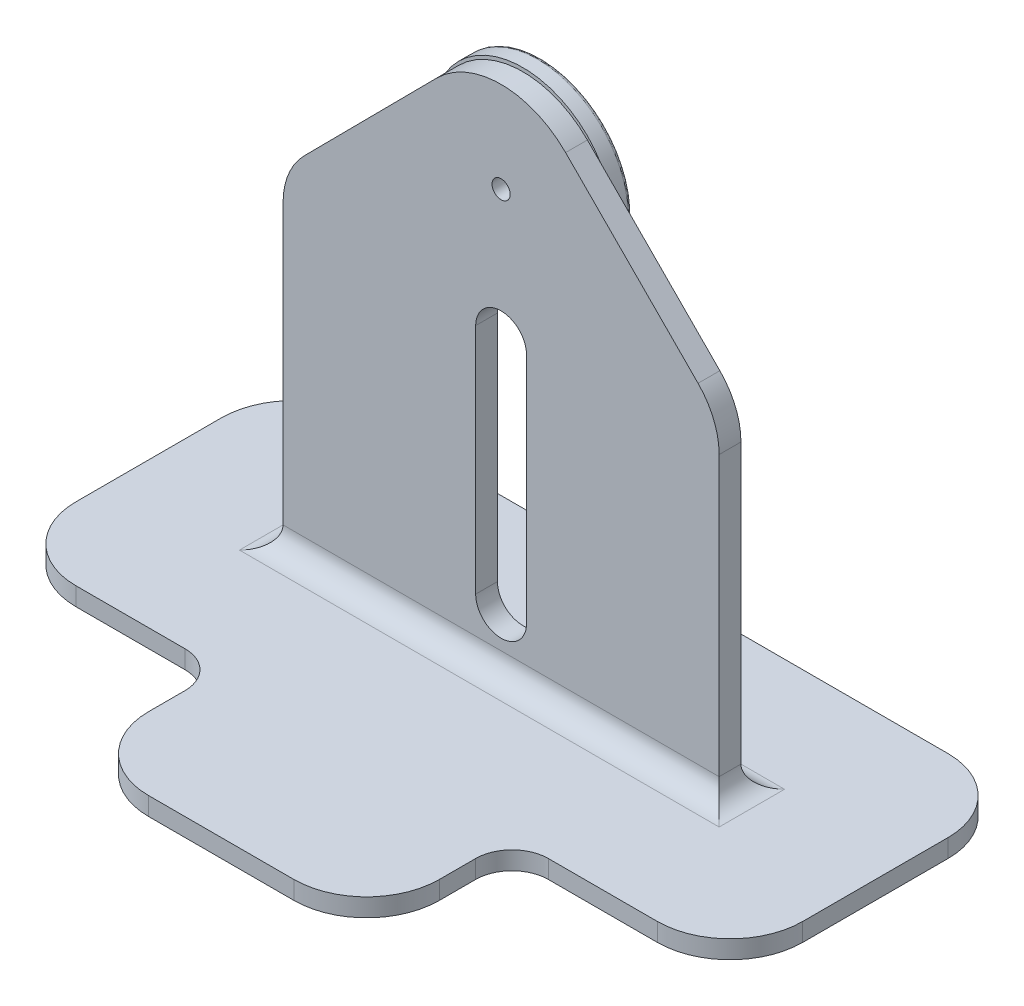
ISO-10303-21;
HEADER;
FILE_DESCRIPTION(('STEP AP214'),'2;1');
FILE_NAME('part.step','',(''),(''),'','','');
FILE_SCHEMA(('AUTOMOTIVE_DESIGN { 1 0 10303 214 1 1 1 1 }'));
ENDSEC;
DATA;
#1=APPLICATION_CONTEXT('core data for automotive mechanical design processes');
#2=APPLICATION_PROTOCOL_DEFINITION('international standard','automotive_design',2000,#1);
#3=PRODUCT_CONTEXT('',#1,'mechanical');
#4=PRODUCT('Part','Part','',(#3));
#5=PRODUCT_RELATED_PRODUCT_CATEGORY('part','',(#4));
#6=PRODUCT_DEFINITION_FORMATION('','',#4);
#7=PRODUCT_DEFINITION_CONTEXT('part definition',#1,'design');
#8=PRODUCT_DEFINITION('design','',#6,#7);
#9=PRODUCT_DEFINITION_SHAPE('','',#8);
#10=(LENGTH_UNIT() NAMED_UNIT(*) SI_UNIT(.MILLI.,.METRE.));
#11=(NAMED_UNIT(*) PLANE_ANGLE_UNIT() SI_UNIT($,.RADIAN.));
#12=(NAMED_UNIT(*) SI_UNIT($,.STERADIAN.) SOLID_ANGLE_UNIT());
#13=UNCERTAINTY_MEASURE_WITH_UNIT(LENGTH_MEASURE(1.E-05),#10,'distance_accuracy_value','');
#14=(GEOMETRIC_REPRESENTATION_CONTEXT(3) GLOBAL_UNCERTAINTY_ASSIGNED_CONTEXT((#13)) GLOBAL_UNIT_ASSIGNED_CONTEXT((#10,
#11,#12)) REPRESENTATION_CONTEXT('',''));
#15=CARTESIAN_POINT('',(0.,0.,0.));
#16=DIRECTION('',(0.,0.,1.));
#17=DIRECTION('',(1.,0.,0.));
#18=AXIS2_PLACEMENT_3D('',#15,#16,#17);
#19=CARTESIAN_POINT('',(90.0000000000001,77.5,-21.5));
#20=DIRECTION('',(0.,0.,1.));
#21=DIRECTION('',(1.,0.,0.));
#22=AXIS2_PLACEMENT_3D('',#19,#20,#21);
#23=PLANE('',#22);
#24=DIRECTION('',(0.,1.,0.));
#25=VECTOR('',#24,1.);
#26=CARTESIAN_POINT('',(63.5,77.5,-21.5));
#27=LINE('',#26,#25);
#28=CARTESIAN_POINT('',(63.5,10.5,-21.5));
#29=VERTEX_POINT('',#28);
#30=CARTESIAN_POINT('',(63.5,42.5,-21.5));
#31=VERTEX_POINT('',#30);
#32=EDGE_CURVE('E311',#29,#31,#27,.T.);
#33=ORIENTED_EDGE('',*,*,#32,.T.);
#34=CARTESIAN_POINT('',(60.,42.5,-21.5));
#35=DIRECTION('',(0.,0.,1.));
#36=DIRECTION('',(1.,0.,0.));
#37=AXIS2_PLACEMENT_3D('',#34,#35,#36);
#38=CIRCLE('',#37,3.50000000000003);
#39=CARTESIAN_POINT('',(56.5,42.5,-21.5));
#40=VERTEX_POINT('',#39);
#41=EDGE_CURVE('E314',#31,#40,#38,.T.);
#42=ORIENTED_EDGE('',*,*,#41,.T.);
#43=DIRECTION('',(0.,-1.,0.));
#44=VECTOR('',#43,1.);
#45=CARTESIAN_POINT('',(56.5,77.5,-21.5));
#46=LINE('',#45,#44);
#47=CARTESIAN_POINT('',(56.5,10.5,-21.5));
#48=VERTEX_POINT('',#47);
#49=EDGE_CURVE('E299',#40,#48,#46,.T.);
#50=ORIENTED_EDGE('',*,*,#49,.T.);
#51=CARTESIAN_POINT('',(60.,10.5,-21.5));
#52=DIRECTION('',(0.,0.,1.));
#53=DIRECTION('',(1.,0.,0.));
#54=AXIS2_PLACEMENT_3D('',#51,#52,#53);
#55=CIRCLE('',#54,3.50000000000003);
#56=EDGE_CURVE('E308',#48,#29,#55,.T.);
#57=ORIENTED_EDGE('',*,*,#56,.T.);
#58=EDGE_LOOP('',(#33,#42,#50,#57));
#59=FACE_BOUND('',#58,.T.);
#60=DIRECTION('',(0.,-1.,0.));
#61=VECTOR('',#60,1.);
#62=CARTESIAN_POINT('',(90.0000000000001,77.5,-21.5));
#63=LINE('',#62,#61);
#64=CARTESIAN_POINT('',(90.0000000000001,43.8823529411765,-21.5));
#65=VERTEX_POINT('',#64);
#66=CARTESIAN_POINT('',(90.0000000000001,5.49999999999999,-21.5));
#67=VERTEX_POINT('',#66);
#68=EDGE_CURVE('E330',#65,#67,#63,.T.);
#69=ORIENTED_EDGE('',*,*,#68,.T.);
#70=DIRECTION('',(-1.,0.,0.));
#71=VECTOR('',#70,1.);
#72=CARTESIAN_POINT('',(90.0000000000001,5.50000000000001,-21.5));
#73=LINE('',#72,#71);
#74=CARTESIAN_POINT('',(30.0000000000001,5.49999999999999,-21.5));
#75=VERTEX_POINT('',#74);
#76=EDGE_CURVE('E469',#67,#75,#73,.T.);
#77=ORIENTED_EDGE('',*,*,#76,.T.);
#78=DIRECTION('',(0.,-1.,0.));
#79=VECTOR('',#78,1.);
#80=CARTESIAN_POINT('',(30.0000000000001,77.5,-21.5));
#81=LINE('',#80,#79);
#82=CARTESIAN_POINT('',(30.0000000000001,43.8823529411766,-21.5));
#83=VERTEX_POINT('',#82);
#84=EDGE_CURVE('E328',#83,#75,#81,.T.);
#85=ORIENTED_EDGE('',*,*,#84,.F.);
#86=CARTESIAN_POINT('',(40.0000000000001,43.8823529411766,-21.5));
#87=DIRECTION('',(0.,0.,1.));
#88=DIRECTION('',(1.,0.,0.));
#89=AXIS2_PLACEMENT_3D('',#86,#87,#88);
#90=CIRCLE('',#89,10.);
#91=CARTESIAN_POINT('',(32.8994082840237,50.9237730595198,-21.5));
#92=VERTEX_POINT('',#91);
#93=EDGE_CURVE('E454',#83,#92,#90,.F.);
#94=ORIENTED_EDGE('',*,*,#93,.T.);
#95=DIRECTION('',(0.704142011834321,0.710059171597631,0.));
#96=VECTOR('',#95,1.);
#97=CARTESIAN_POINT('',(74.4984419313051,92.8723784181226,-21.5));
#98=LINE('',#97,#96);
#99=CARTESIAN_POINT('',(49.2999800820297,67.4621647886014,-21.5));
#100=VERTEX_POINT('',#99);
#101=EDGE_CURVE('E255',#92,#100,#98,.T.);
#102=ORIENTED_EDGE('',*,*,#101,.T.);
#103=CARTESIAN_POINT('',(60.,61.,-21.5));
#104=DIRECTION('',(0.,0.,-1.));
#105=DIRECTION('',(-1.,0.,0.));
#106=AXIS2_PLACEMENT_3D('',#103,#104,#105);
#107=CIRCLE('',#106,12.5);
#108=CARTESIAN_POINT('',(70.7000199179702,67.4621647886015,-21.5));
#109=VERTEX_POINT('',#108);
#110=EDGE_CURVE('E252',#109,#100,#107,.T.);
#111=ORIENTED_EDGE('',*,*,#110,.F.);
#112=DIRECTION('',(0.704142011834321,-0.710059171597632,0.));
#113=VECTOR('',#112,1.);
#114=CARTESIAN_POINT('',(75.2505164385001,62.8734288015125,-21.5));
#115=LINE('',#114,#113);
#116=CARTESIAN_POINT('',(87.1005917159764,50.9237730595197,-21.5));
#117=VERTEX_POINT('',#116);
#118=EDGE_CURVE('E236',#109,#117,#115,.T.);
#119=ORIENTED_EDGE('',*,*,#118,.T.);
#120=CARTESIAN_POINT('',(80.0000000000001,43.8823529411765,-21.5));
#121=DIRECTION('',(0.,0.,1.));
#122=DIRECTION('',(1.,0.,0.));
#123=AXIS2_PLACEMENT_3D('',#120,#121,#122);
#124=CIRCLE('',#123,10.);
#125=EDGE_CURVE('E456',#117,#65,#124,.F.);
#126=ORIENTED_EDGE('',*,*,#125,.T.);
#127=EDGE_LOOP('',(#69,#77,#85,#94,#102,#111,#119,#126));
#128=FACE_BOUND('',#127,.T.);
#129=ADVANCED_FACE('F27',(#59,#128),#23,.F.);
#130=CARTESIAN_POINT('',(19.9999999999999,2.5,-30.));
#131=DIRECTION('',(0.,1.,0.));
#132=DIRECTION('',(0.,0.,1.));
#133=AXIS2_PLACEMENT_3D('',#130,#131,#132);
#134=PLANE('',#133);
#135=DIRECTION('',(1.,0.,0.));
#136=VECTOR('',#135,1.);
#137=CARTESIAN_POINT('',(19.9999999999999,2.5,-15.5));
#138=LINE('',#137,#136);
#139=CARTESIAN_POINT('',(93.0000000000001,2.5,-15.5));
#140=VERTEX_POINT('',#139);
#141=CARTESIAN_POINT('',(27.0000000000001,2.5,-15.5));
#142=VERTEX_POINT('',#141);
#143=EDGE_CURVE('E474',#140,#142,#138,.F.);
#144=ORIENTED_EDGE('',*,*,#143,.T.);
#145=DIRECTION('',(0.,0.,1.));
#146=VECTOR('',#145,1.);
#147=CARTESIAN_POINT('',(27.0000000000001,2.5,-30.));
#148=LINE('',#147,#146);
#149=CARTESIAN_POINT('',(27.0000000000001,2.5,-24.5));
#150=VERTEX_POINT('',#149);
#151=EDGE_CURVE('E479',#142,#150,#148,.F.);
#152=ORIENTED_EDGE('',*,*,#151,.T.);
#153=DIRECTION('',(-1.,0.,0.));
#154=VECTOR('',#153,1.);
#155=CARTESIAN_POINT('',(19.9999999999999,2.5,-24.5));
#156=LINE('',#155,#154);
#157=CARTESIAN_POINT('',(93.0000000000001,2.5,-24.5));
#158=VERTEX_POINT('',#157);
#159=EDGE_CURVE('E476',#150,#158,#156,.F.);
#160=ORIENTED_EDGE('',*,*,#159,.T.);
#161=DIRECTION('',(0.,0.,-1.));
#162=VECTOR('',#161,1.);
#163=CARTESIAN_POINT('',(93.0000000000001,2.5,-30.));
#164=LINE('',#163,#162);
#165=EDGE_CURVE('E472',#158,#140,#164,.F.);
#166=ORIENTED_EDGE('',*,*,#165,.T.);
#167=EDGE_LOOP('',(#144,#152,#160,#166));
#168=FACE_BOUND('',#167,.T.);
#169=CARTESIAN_POINT('',(19.9999999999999,2.5,-30.));
#170=DIRECTION('',(0.,1.,0.));
#171=DIRECTION('',(0.,0.,1.));
#172=AXIS2_PLACEMENT_3D('',#169,#170,#171);
#173=CIRCLE('',#172,10.);
#174=CARTESIAN_POINT('',(20.,2.5,-40.));
#175=VERTEX_POINT('',#174);
#176=CARTESIAN_POINT('',(9.99999999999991,2.5,-30.));
#177=VERTEX_POINT('',#176);
#178=EDGE_CURVE('E365',#175,#177,#173,.T.);
#179=ORIENTED_EDGE('',*,*,#178,.T.);
#180=DIRECTION('',(0.,0.,1.));
#181=VECTOR('',#180,1.);
#182=CARTESIAN_POINT('',(9.99999999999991,2.5,-9.99999999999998));
#183=LINE('',#182,#181);
#184=CARTESIAN_POINT('',(9.99999999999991,2.5,-9.99999999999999));
#185=VERTEX_POINT('',#184);
#186=EDGE_CURVE('E368',#177,#185,#183,.T.);
#187=ORIENTED_EDGE('',*,*,#186,.T.);
#188=CARTESIAN_POINT('',(19.9999999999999,2.5,-9.99999999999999));
#189=DIRECTION('',(0.,1.,0.));
#190=DIRECTION('',(0.,0.,-1.));
#191=AXIS2_PLACEMENT_3D('',#188,#189,#190);
#192=CIRCLE('',#191,10.);
#193=CARTESIAN_POINT('',(20.,2.5,0.));
#194=VERTEX_POINT('',#193);
#195=EDGE_CURVE('E370',#185,#194,#192,.T.);
#196=ORIENTED_EDGE('',*,*,#195,.T.);
#197=DIRECTION('',(1.,0.,0.));
#198=VECTOR('',#197,1.);
#199=CARTESIAN_POINT('',(35.,2.5,0.));
#200=LINE('',#199,#198);
#201=CARTESIAN_POINT('',(35.,2.5,0.));
#202=VERTEX_POINT('',#201);
#203=EDGE_CURVE('E372',#194,#202,#200,.T.);
#204=ORIENTED_EDGE('',*,*,#203,.T.);
#205=CARTESIAN_POINT('',(35.,2.5,5.));
#206=DIRECTION('',(0.,-1.,0.));
#207=DIRECTION('',(0.,0.,1.));
#208=AXIS2_PLACEMENT_3D('',#205,#206,#207);
#209=CIRCLE('',#208,5.);
#210=CARTESIAN_POINT('',(40.,2.5,5.00000000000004));
#211=VERTEX_POINT('',#210);
#212=EDGE_CURVE('E374',#202,#211,#209,.T.);
#213=ORIENTED_EDGE('',*,*,#212,.T.);
#214=DIRECTION('',(0.,0.,1.));
#215=VECTOR('',#214,1.);
#216=CARTESIAN_POINT('',(40.,2.5,5.00000000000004));
#217=LINE('',#216,#215);
#218=CARTESIAN_POINT('',(40.,2.5,9.99999999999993));
#219=VERTEX_POINT('',#218);
#220=EDGE_CURVE('E376',#211,#219,#217,.T.);
#221=ORIENTED_EDGE('',*,*,#220,.T.);
#222=CARTESIAN_POINT('',(50.,2.5,10.));
#223=DIRECTION('',(0.,1.,0.));
#224=DIRECTION('',(0.,0.,-1.));
#225=AXIS2_PLACEMENT_3D('',#222,#223,#224);
#226=CIRCLE('',#225,10.);
#227=CARTESIAN_POINT('',(50.0000000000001,2.5,20.));
#228=VERTEX_POINT('',#227);
#229=EDGE_CURVE('E378',#219,#228,#226,.T.);
#230=ORIENTED_EDGE('',*,*,#229,.T.);
#231=DIRECTION('',(1.,0.,0.));
#232=VECTOR('',#231,1.);
#233=CARTESIAN_POINT('',(50.0000000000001,2.5,20.));
#234=LINE('',#233,#232);
#235=CARTESIAN_POINT('',(69.9999999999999,2.5,20.));
#236=VERTEX_POINT('',#235);
#237=EDGE_CURVE('E380',#228,#236,#234,.T.);
#238=ORIENTED_EDGE('',*,*,#237,.T.);
#239=CARTESIAN_POINT('',(70.,2.5,10.));
#240=DIRECTION('',(0.,1.,0.));
#241=DIRECTION('',(0.,0.,1.));
#242=AXIS2_PLACEMENT_3D('',#239,#240,#241);
#243=CIRCLE('',#242,10.);
#244=CARTESIAN_POINT('',(80.,2.5,9.99999999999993));
#245=VERTEX_POINT('',#244);
#246=EDGE_CURVE('E382',#236,#245,#243,.T.);
#247=ORIENTED_EDGE('',*,*,#246,.T.);
#248=DIRECTION('',(0.,0.,-1.));
#249=VECTOR('',#248,1.);
#250=CARTESIAN_POINT('',(80.,2.5,5.00000000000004));
#251=LINE('',#250,#249);
#252=CARTESIAN_POINT('',(80.,2.5,5.00000000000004));
#253=VERTEX_POINT('',#252);
#254=EDGE_CURVE('E384',#245,#253,#251,.T.);
#255=ORIENTED_EDGE('',*,*,#254,.T.);
#256=CARTESIAN_POINT('',(85.,2.5,5.));
#257=DIRECTION('',(0.,-1.,0.));
#258=DIRECTION('',(0.,0.,-1.));
#259=AXIS2_PLACEMENT_3D('',#256,#257,#258);
#260=CIRCLE('',#259,5.);
#261=CARTESIAN_POINT('',(85.,2.5,0.));
#262=VERTEX_POINT('',#261);
#263=EDGE_CURVE('E386',#253,#262,#260,.T.);
#264=ORIENTED_EDGE('',*,*,#263,.T.);
#265=DIRECTION('',(1.,0.,0.));
#266=VECTOR('',#265,1.);
#267=CARTESIAN_POINT('',(85.,2.5,0.));
#268=LINE('',#267,#266);
#269=CARTESIAN_POINT('',(100.,2.5,0.));
#270=VERTEX_POINT('',#269);
#271=EDGE_CURVE('E388',#262,#270,#268,.T.);
#272=ORIENTED_EDGE('',*,*,#271,.T.);
#273=CARTESIAN_POINT('',(100.,2.5,-10.));
#274=DIRECTION('',(0.,1.,0.));
#275=DIRECTION('',(0.,0.,1.));
#276=AXIS2_PLACEMENT_3D('',#273,#274,#275);
#277=CIRCLE('',#276,10.);
#278=CARTESIAN_POINT('',(110.,2.5,-10.));
#279=VERTEX_POINT('',#278);
#280=EDGE_CURVE('E390',#270,#279,#277,.T.);
#281=ORIENTED_EDGE('',*,*,#280,.T.);
#282=DIRECTION('',(0.,0.,-1.));
#283=VECTOR('',#282,1.);
#284=CARTESIAN_POINT('',(110.,2.5,-10.));
#285=LINE('',#284,#283);
#286=CARTESIAN_POINT('',(110.,2.5,-30.));
#287=VERTEX_POINT('',#286);
#288=EDGE_CURVE('E392',#279,#287,#285,.T.);
#289=ORIENTED_EDGE('',*,*,#288,.T.);
#290=CARTESIAN_POINT('',(100.,2.5,-30.));
#291=DIRECTION('',(0.,1.,0.));
#292=DIRECTION('',(0.,0.,1.));
#293=AXIS2_PLACEMENT_3D('',#290,#291,#292);
#294=CIRCLE('',#293,10.);
#295=CARTESIAN_POINT('',(100.,2.5,-40.));
#296=VERTEX_POINT('',#295);
#297=EDGE_CURVE('E394',#287,#296,#294,.T.);
#298=ORIENTED_EDGE('',*,*,#297,.T.);
#299=DIRECTION('',(-1.,0.,0.));
#300=VECTOR('',#299,1.);
#301=CARTESIAN_POINT('',(20.,2.5,-40.));
#302=LINE('',#301,#300);
#303=EDGE_CURVE('E396',#296,#175,#302,.T.);
#304=ORIENTED_EDGE('',*,*,#303,.T.);
#305=EDGE_LOOP('',(#179,#187,#196,#204,#213,#221,#230,#238,#247,#255,#264,#272,#281,#289,#298,#304));
#306=FACE_BOUND('',#305,.T.);
#307=ADVANCED_FACE('F484',(#168,#306),#134,.T.);
#308=CARTESIAN_POINT('',(19.9999999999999,2.5,-30.));
#309=DIRECTION('',(0.,-1.,0.));
#310=DIRECTION('',(0.,0.,-1.));
#311=AXIS2_PLACEMENT_3D('',#308,#309,#310);
#312=CYLINDRICAL_SURFACE('',#311,10.);
#313=CARTESIAN_POINT('',(19.9999999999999,0.,-30.));
#314=DIRECTION('',(0.,1.,0.));
#315=DIRECTION('',(0.,0.,1.));
#316=AXIS2_PLACEMENT_3D('',#313,#314,#315);
#317=CIRCLE('',#316,10.);
#318=CARTESIAN_POINT('',(20.,0.,-40.));
#319=VERTEX_POINT('',#318);
#320=CARTESIAN_POINT('',(9.99999999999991,0.,-30.));
#321=VERTEX_POINT('',#320);
#322=EDGE_CURVE('E332',#319,#321,#317,.T.);
#323=ORIENTED_EDGE('',*,*,#322,.T.);
#324=DIRECTION('',(0.,-1.,0.));
#325=VECTOR('',#324,1.);
#326=CARTESIAN_POINT('',(9.99999999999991,2.5,-30.));
#327=LINE('',#326,#325);
#328=EDGE_CURVE('E443',#177,#321,#327,.T.);
#329=ORIENTED_EDGE('',*,*,#328,.F.);
#330=ORIENTED_EDGE('',*,*,#178,.F.);
#331=DIRECTION('',(0.,-1.,0.));
#332=VECTOR('',#331,1.);
#333=CARTESIAN_POINT('',(20.,2.5,-40.));
#334=LINE('',#333,#332);
#335=EDGE_CURVE('E398',#175,#319,#334,.T.);
#336=ORIENTED_EDGE('',*,*,#335,.T.);
#337=EDGE_LOOP('',(#323,#329,#330,#336));
#338=FACE_BOUND('',#337,.T.);
#339=ADVANCED_FACE('F29',(#338),#312,.T.);
#340=CARTESIAN_POINT('',(9.99999999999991,2.5,-9.99999999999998));
#341=DIRECTION('',(1.,0.,0.));
#342=DIRECTION('',(0.,0.,-1.));
#343=AXIS2_PLACEMENT_3D('',#340,#341,#342);
#344=PLANE('',#343);
#345=DIRECTION('',(0.,0.,1.));
#346=VECTOR('',#345,1.);
#347=CARTESIAN_POINT('',(9.99999999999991,0.,-9.99999999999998));
#348=LINE('',#347,#346);
#349=CARTESIAN_POINT('',(9.99999999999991,0.,-9.99999999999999));
#350=VERTEX_POINT('',#349);
#351=EDGE_CURVE('E335',#321,#350,#348,.T.);
#352=ORIENTED_EDGE('',*,*,#351,.T.);
#353=DIRECTION('',(0.,-1.,0.));
#354=VECTOR('',#353,1.);
#355=CARTESIAN_POINT('',(9.99999999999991,2.5,-9.99999999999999));
#356=LINE('',#355,#354);
#357=EDGE_CURVE('E440',#185,#350,#356,.T.);
#358=ORIENTED_EDGE('',*,*,#357,.F.);
#359=ORIENTED_EDGE('',*,*,#186,.F.);
#360=ORIENTED_EDGE('',*,*,#328,.T.);
#361=EDGE_LOOP('',(#352,#358,#359,#360));
#362=FACE_BOUND('',#361,.T.);
#363=ADVANCED_FACE('F619',(#362),#344,.F.);
#364=CARTESIAN_POINT('',(19.9999999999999,2.5,-9.99999999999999));
#365=DIRECTION('',(0.,-1.,0.));
#366=DIRECTION('',(0.,0.,-1.));
#367=AXIS2_PLACEMENT_3D('',#364,#365,#366);
#368=CYLINDRICAL_SURFACE('',#367,10.);
#369=CARTESIAN_POINT('',(19.9999999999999,0.,-9.99999999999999));
#370=DIRECTION('',(0.,1.,0.));
#371=DIRECTION('',(0.,0.,-1.));
#372=AXIS2_PLACEMENT_3D('',#369,#370,#371);
#373=CIRCLE('',#372,10.);
#374=CARTESIAN_POINT('',(20.,0.,0.));
#375=VERTEX_POINT('',#374);
#376=EDGE_CURVE('E337',#350,#375,#373,.T.);
#377=ORIENTED_EDGE('',*,*,#376,.T.);
#378=DIRECTION('',(0.,-1.,0.));
#379=VECTOR('',#378,1.);
#380=CARTESIAN_POINT('',(20.,2.5,0.));
#381=LINE('',#380,#379);
#382=EDGE_CURVE('E437',#194,#375,#381,.T.);
#383=ORIENTED_EDGE('',*,*,#382,.F.);
#384=ORIENTED_EDGE('',*,*,#195,.F.);
#385=ORIENTED_EDGE('',*,*,#357,.T.);
#386=EDGE_LOOP('',(#377,#383,#384,#385));
#387=FACE_BOUND('',#386,.T.);
#388=ADVANCED_FACE('F616',(#387),#368,.T.);
#389=CARTESIAN_POINT('',(35.,2.5,0.));
#390=DIRECTION('',(0.,0.,-1.));
#391=DIRECTION('',(-1.,0.,0.));
#392=AXIS2_PLACEMENT_3D('',#389,#390,#391);
#393=PLANE('',#392);
#394=DIRECTION('',(1.,0.,0.));
#395=VECTOR('',#394,1.);
#396=CARTESIAN_POINT('',(35.,0.,0.));
#397=LINE('',#396,#395);
#398=CARTESIAN_POINT('',(35.,0.,0.));
#399=VERTEX_POINT('',#398);
#400=EDGE_CURVE('E339',#375,#399,#397,.T.);
#401=ORIENTED_EDGE('',*,*,#400,.T.);
#402=DIRECTION('',(0.,-1.,0.));
#403=VECTOR('',#402,1.);
#404=CARTESIAN_POINT('',(35.,2.5,0.));
#405=LINE('',#404,#403);
#406=EDGE_CURVE('E434',#202,#399,#405,.T.);
#407=ORIENTED_EDGE('',*,*,#406,.F.);
#408=ORIENTED_EDGE('',*,*,#203,.F.);
#409=ORIENTED_EDGE('',*,*,#382,.T.);
#410=EDGE_LOOP('',(#401,#407,#408,#409));
#411=FACE_BOUND('',#410,.T.);
#412=ADVANCED_FACE('F612',(#411),#393,.F.);
#413=CARTESIAN_POINT('',(35.,2.5,5.));
#414=DIRECTION('',(0.,-1.,0.));
#415=DIRECTION('',(0.,0.,-1.));
#416=AXIS2_PLACEMENT_3D('',#413,#414,#415);
#417=CYLINDRICAL_SURFACE('',#416,5.);
#418=CARTESIAN_POINT('',(35.,0.,5.));
#419=DIRECTION('',(0.,-1.,0.));
#420=DIRECTION('',(0.,0.,1.));
#421=AXIS2_PLACEMENT_3D('',#418,#419,#420);
#422=CIRCLE('',#421,5.);
#423=CARTESIAN_POINT('',(40.,0.,5.00000000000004));
#424=VERTEX_POINT('',#423);
#425=EDGE_CURVE('E341',#399,#424,#422,.T.);
#426=ORIENTED_EDGE('',*,*,#425,.T.);
#427=DIRECTION('',(0.,-1.,0.));
#428=VECTOR('',#427,1.);
#429=CARTESIAN_POINT('',(40.,2.5,5.00000000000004));
#430=LINE('',#429,#428);
#431=EDGE_CURVE('E431',#211,#424,#430,.T.);
#432=ORIENTED_EDGE('',*,*,#431,.F.);
#433=ORIENTED_EDGE('',*,*,#212,.F.);
#434=ORIENTED_EDGE('',*,*,#406,.T.);
#435=EDGE_LOOP('',(#426,#432,#433,#434));
#436=FACE_BOUND('',#435,.T.);
#437=ADVANCED_FACE('F608',(#436),#417,.F.);
#438=CARTESIAN_POINT('',(40.,2.5,5.00000000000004));
#439=DIRECTION('',(1.,0.,0.));
#440=DIRECTION('',(0.,0.,-1.));
#441=AXIS2_PLACEMENT_3D('',#438,#439,#440);
#442=PLANE('',#441);
#443=DIRECTION('',(0.,0.,1.));
#444=VECTOR('',#443,1.);
#445=CARTESIAN_POINT('',(40.,0.,5.00000000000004));
#446=LINE('',#445,#444);
#447=CARTESIAN_POINT('',(40.,0.,9.99999999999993));
#448=VERTEX_POINT('',#447);
#449=EDGE_CURVE('E343',#424,#448,#446,.T.);
#450=ORIENTED_EDGE('',*,*,#449,.T.);
#451=DIRECTION('',(0.,-1.,0.));
#452=VECTOR('',#451,1.);
#453=CARTESIAN_POINT('',(40.,2.5,9.99999999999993));
#454=LINE('',#453,#452);
#455=EDGE_CURVE('E428',#219,#448,#454,.T.);
#456=ORIENTED_EDGE('',*,*,#455,.F.);
#457=ORIENTED_EDGE('',*,*,#220,.F.);
#458=ORIENTED_EDGE('',*,*,#431,.T.);
#459=EDGE_LOOP('',(#450,#456,#457,#458));
#460=FACE_BOUND('',#459,.T.);
#461=ADVANCED_FACE('F604',(#460),#442,.F.);
#462=CARTESIAN_POINT('',(50.,2.5,10.));
#463=DIRECTION('',(0.,-1.,0.));
#464=DIRECTION('',(0.,0.,-1.));
#465=AXIS2_PLACEMENT_3D('',#462,#463,#464);
#466=CYLINDRICAL_SURFACE('',#465,10.);
#467=CARTESIAN_POINT('',(50.,0.,10.));
#468=DIRECTION('',(0.,1.,0.));
#469=DIRECTION('',(0.,0.,-1.));
#470=AXIS2_PLACEMENT_3D('',#467,#468,#469);
#471=CIRCLE('',#470,10.);
#472=CARTESIAN_POINT('',(50.0000000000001,0.,20.));
#473=VERTEX_POINT('',#472);
#474=EDGE_CURVE('E345',#448,#473,#471,.T.);
#475=ORIENTED_EDGE('',*,*,#474,.T.);
#476=DIRECTION('',(0.,-1.,0.));
#477=VECTOR('',#476,1.);
#478=CARTESIAN_POINT('',(50.0000000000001,2.5,20.));
#479=LINE('',#478,#477);
#480=EDGE_CURVE('E425',#228,#473,#479,.T.);
#481=ORIENTED_EDGE('',*,*,#480,.F.);
#482=ORIENTED_EDGE('',*,*,#229,.F.);
#483=ORIENTED_EDGE('',*,*,#455,.T.);
#484=EDGE_LOOP('',(#475,#481,#482,#483));
#485=FACE_BOUND('',#484,.T.);
#486=ADVANCED_FACE('F600',(#485),#466,.T.);
#487=CARTESIAN_POINT('',(50.0000000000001,2.5,20.));
#488=DIRECTION('',(0.,0.,-1.));
#489=DIRECTION('',(-1.,0.,0.));
#490=AXIS2_PLACEMENT_3D('',#487,#488,#489);
#491=PLANE('',#490);
#492=DIRECTION('',(1.,0.,0.));
#493=VECTOR('',#492,1.);
#494=CARTESIAN_POINT('',(50.0000000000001,0.,20.));
#495=LINE('',#494,#493);
#496=CARTESIAN_POINT('',(69.9999999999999,0.,20.));
#497=VERTEX_POINT('',#496);
#498=EDGE_CURVE('E347',#473,#497,#495,.T.);
#499=ORIENTED_EDGE('',*,*,#498,.T.);
#500=DIRECTION('',(0.,-1.,0.));
#501=VECTOR('',#500,1.);
#502=CARTESIAN_POINT('',(69.9999999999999,2.5,20.));
#503=LINE('',#502,#501);
#504=EDGE_CURVE('E422',#236,#497,#503,.T.);
#505=ORIENTED_EDGE('',*,*,#504,.F.);
#506=ORIENTED_EDGE('',*,*,#237,.F.);
#507=ORIENTED_EDGE('',*,*,#480,.T.);
#508=EDGE_LOOP('',(#499,#505,#506,#507));
#509=FACE_BOUND('',#508,.T.);
#510=ADVANCED_FACE('F596',(#509),#491,.F.);
#511=CARTESIAN_POINT('',(70.,2.5,10.));
#512=DIRECTION('',(0.,-1.,0.));
#513=DIRECTION('',(0.,0.,-1.));
#514=AXIS2_PLACEMENT_3D('',#511,#512,#513);
#515=CYLINDRICAL_SURFACE('',#514,10.);
#516=CARTESIAN_POINT('',(70.,0.,10.));
#517=DIRECTION('',(0.,1.,0.));
#518=DIRECTION('',(0.,0.,1.));
#519=AXIS2_PLACEMENT_3D('',#516,#517,#518);
#520=CIRCLE('',#519,10.);
#521=CARTESIAN_POINT('',(80.,0.,9.99999999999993));
#522=VERTEX_POINT('',#521);
#523=EDGE_CURVE('E349',#497,#522,#520,.T.);
#524=ORIENTED_EDGE('',*,*,#523,.T.);
#525=DIRECTION('',(0.,-1.,0.));
#526=VECTOR('',#525,1.);
#527=CARTESIAN_POINT('',(80.,2.5,9.99999999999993));
#528=LINE('',#527,#526);
#529=EDGE_CURVE('E419',#245,#522,#528,.T.);
#530=ORIENTED_EDGE('',*,*,#529,.F.);
#531=ORIENTED_EDGE('',*,*,#246,.F.);
#532=ORIENTED_EDGE('',*,*,#504,.T.);
#533=EDGE_LOOP('',(#524,#530,#531,#532));
#534=FACE_BOUND('',#533,.T.);
#535=ADVANCED_FACE('F592',(#534),#515,.T.);
#536=CARTESIAN_POINT('',(80.,2.5,5.00000000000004));
#537=DIRECTION('',(-1.,0.,0.));
#538=DIRECTION('',(0.,0.,1.));
#539=AXIS2_PLACEMENT_3D('',#536,#537,#538);
#540=PLANE('',#539);
#541=DIRECTION('',(0.,0.,-1.));
#542=VECTOR('',#541,1.);
#543=CARTESIAN_POINT('',(80.,0.,5.00000000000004));
#544=LINE('',#543,#542);
#545=CARTESIAN_POINT('',(80.,0.,5.00000000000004));
#546=VERTEX_POINT('',#545);
#547=EDGE_CURVE('E351',#522,#546,#544,.T.);
#548=ORIENTED_EDGE('',*,*,#547,.T.);
#549=DIRECTION('',(0.,-1.,0.));
#550=VECTOR('',#549,1.);
#551=CARTESIAN_POINT('',(80.,2.5,5.00000000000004));
#552=LINE('',#551,#550);
#553=EDGE_CURVE('E416',#253,#546,#552,.T.);
#554=ORIENTED_EDGE('',*,*,#553,.F.);
#555=ORIENTED_EDGE('',*,*,#254,.F.);
#556=ORIENTED_EDGE('',*,*,#529,.T.);
#557=EDGE_LOOP('',(#548,#554,#555,#556));
#558=FACE_BOUND('',#557,.T.);
#559=ADVANCED_FACE('F588',(#558),#540,.F.);
#560=CARTESIAN_POINT('',(85.,2.5,5.));
#561=DIRECTION('',(0.,-1.,0.));
#562=DIRECTION('',(0.,0.,-1.));
#563=AXIS2_PLACEMENT_3D('',#560,#561,#562);
#564=CYLINDRICAL_SURFACE('',#563,5.);
#565=CARTESIAN_POINT('',(85.,0.,5.));
#566=DIRECTION('',(0.,-1.,0.));
#567=DIRECTION('',(0.,0.,-1.));
#568=AXIS2_PLACEMENT_3D('',#565,#566,#567);
#569=CIRCLE('',#568,5.);
#570=CARTESIAN_POINT('',(85.,0.,0.));
#571=VERTEX_POINT('',#570);
#572=EDGE_CURVE('E353',#546,#571,#569,.T.);
#573=ORIENTED_EDGE('',*,*,#572,.T.);
#574=DIRECTION('',(0.,-1.,0.));
#575=VECTOR('',#574,1.);
#576=CARTESIAN_POINT('',(85.,2.5,0.));
#577=LINE('',#576,#575);
#578=EDGE_CURVE('E413',#262,#571,#577,.T.);
#579=ORIENTED_EDGE('',*,*,#578,.F.);
#580=ORIENTED_EDGE('',*,*,#263,.F.);
#581=ORIENTED_EDGE('',*,*,#553,.T.);
#582=EDGE_LOOP('',(#573,#579,#580,#581));
#583=FACE_BOUND('',#582,.T.);
#584=ADVANCED_FACE('F584',(#583),#564,.F.);
#585=CARTESIAN_POINT('',(85.,2.5,0.));
#586=DIRECTION('',(0.,0.,-1.));
#587=DIRECTION('',(-1.,0.,0.));
#588=AXIS2_PLACEMENT_3D('',#585,#586,#587);
#589=PLANE('',#588);
#590=DIRECTION('',(1.,0.,0.));
#591=VECTOR('',#590,1.);
#592=CARTESIAN_POINT('',(85.,0.,0.));
#593=LINE('',#592,#591);
#594=CARTESIAN_POINT('',(100.,0.,0.));
#595=VERTEX_POINT('',#594);
#596=EDGE_CURVE('E355',#571,#595,#593,.T.);
#597=ORIENTED_EDGE('',*,*,#596,.T.);
#598=DIRECTION('',(0.,-1.,0.));
#599=VECTOR('',#598,1.);
#600=CARTESIAN_POINT('',(100.,2.5,0.));
#601=LINE('',#600,#599);
#602=EDGE_CURVE('E410',#270,#595,#601,.T.);
#603=ORIENTED_EDGE('',*,*,#602,.F.);
#604=ORIENTED_EDGE('',*,*,#271,.F.);
#605=ORIENTED_EDGE('',*,*,#578,.T.);
#606=EDGE_LOOP('',(#597,#603,#604,#605));
#607=FACE_BOUND('',#606,.T.);
#608=ADVANCED_FACE('F580',(#607),#589,.F.);
#609=CARTESIAN_POINT('',(100.,2.5,-10.));
#610=DIRECTION('',(0.,-1.,0.));
#611=DIRECTION('',(0.,0.,-1.));
#612=AXIS2_PLACEMENT_3D('',#609,#610,#611);
#613=CYLINDRICAL_SURFACE('',#612,10.);
#614=CARTESIAN_POINT('',(100.,0.,-10.));
#615=DIRECTION('',(0.,1.,0.));
#616=DIRECTION('',(0.,0.,1.));
#617=AXIS2_PLACEMENT_3D('',#614,#615,#616);
#618=CIRCLE('',#617,10.);
#619=CARTESIAN_POINT('',(110.,0.,-10.));
#620=VERTEX_POINT('',#619);
#621=EDGE_CURVE('E357',#595,#620,#618,.T.);
#622=ORIENTED_EDGE('',*,*,#621,.T.);
#623=DIRECTION('',(0.,-1.,0.));
#624=VECTOR('',#623,1.);
#625=CARTESIAN_POINT('',(110.,2.5,-10.));
#626=LINE('',#625,#624);
#627=EDGE_CURVE('E407',#279,#620,#626,.T.);
#628=ORIENTED_EDGE('',*,*,#627,.F.);
#629=ORIENTED_EDGE('',*,*,#280,.F.);
#630=ORIENTED_EDGE('',*,*,#602,.T.);
#631=EDGE_LOOP('',(#622,#628,#629,#630));
#632=FACE_BOUND('',#631,.T.);
#633=ADVANCED_FACE('F576',(#632),#613,.T.);
#634=CARTESIAN_POINT('',(110.,2.5,-10.));
#635=DIRECTION('',(-1.,0.,0.));
#636=DIRECTION('',(0.,0.,1.));
#637=AXIS2_PLACEMENT_3D('',#634,#635,#636);
#638=PLANE('',#637);
#639=DIRECTION('',(0.,0.,-1.));
#640=VECTOR('',#639,1.);
#641=CARTESIAN_POINT('',(110.,0.,-10.));
#642=LINE('',#641,#640);
#643=CARTESIAN_POINT('',(110.,0.,-30.));
#644=VERTEX_POINT('',#643);
#645=EDGE_CURVE('E359',#620,#644,#642,.T.);
#646=ORIENTED_EDGE('',*,*,#645,.T.);
#647=DIRECTION('',(0.,-1.,0.));
#648=VECTOR('',#647,1.);
#649=CARTESIAN_POINT('',(110.,2.5,-30.));
#650=LINE('',#649,#648);
#651=EDGE_CURVE('E404',#287,#644,#650,.T.);
#652=ORIENTED_EDGE('',*,*,#651,.F.);
#653=ORIENTED_EDGE('',*,*,#288,.F.);
#654=ORIENTED_EDGE('',*,*,#627,.T.);
#655=EDGE_LOOP('',(#646,#652,#653,#654));
#656=FACE_BOUND('',#655,.T.);
#657=ADVANCED_FACE('F572',(#656),#638,.F.);
#658=CARTESIAN_POINT('',(100.,2.5,-30.));
#659=DIRECTION('',(0.,-1.,0.));
#660=DIRECTION('',(0.,0.,-1.));
#661=AXIS2_PLACEMENT_3D('',#658,#659,#660);
#662=CYLINDRICAL_SURFACE('',#661,10.);
#663=CARTESIAN_POINT('',(100.,0.,-30.));
#664=DIRECTION('',(0.,1.,0.));
#665=DIRECTION('',(0.,0.,1.));
#666=AXIS2_PLACEMENT_3D('',#663,#664,#665);
#667=CIRCLE('',#666,10.);
#668=CARTESIAN_POINT('',(100.,0.,-40.));
#669=VERTEX_POINT('',#668);
#670=EDGE_CURVE('E361',#644,#669,#667,.T.);
#671=ORIENTED_EDGE('',*,*,#670,.T.);
#672=DIRECTION('',(0.,-1.,0.));
#673=VECTOR('',#672,1.);
#674=CARTESIAN_POINT('',(100.,2.5,-40.));
#675=LINE('',#674,#673);
#676=EDGE_CURVE('E401',#296,#669,#675,.T.);
#677=ORIENTED_EDGE('',*,*,#676,.F.);
#678=ORIENTED_EDGE('',*,*,#297,.F.);
#679=ORIENTED_EDGE('',*,*,#651,.T.);
#680=EDGE_LOOP('',(#671,#677,#678,#679));
#681=FACE_BOUND('',#680,.T.);
#682=ADVANCED_FACE('F568',(#681),#662,.T.);
#683=CARTESIAN_POINT('',(20.,2.5,-40.));
#684=DIRECTION('',(0.,0.,1.));
#685=DIRECTION('',(1.,0.,0.));
#686=AXIS2_PLACEMENT_3D('',#683,#684,#685);
#687=PLANE('',#686);
#688=DIRECTION('',(-1.,0.,0.));
#689=VECTOR('',#688,1.);
#690=CARTESIAN_POINT('',(20.,0.,-40.));
#691=LINE('',#690,#689);
#692=EDGE_CURVE('E363',#669,#319,#691,.T.);
#693=ORIENTED_EDGE('',*,*,#692,.T.);
#694=ORIENTED_EDGE('',*,*,#335,.F.);
#695=ORIENTED_EDGE('',*,*,#303,.F.);
#696=ORIENTED_EDGE('',*,*,#676,.T.);
#697=EDGE_LOOP('',(#693,#694,#695,#696));
#698=FACE_BOUND('',#697,.T.);
#699=ADVANCED_FACE('F562',(#698),#687,.F.);
#700=CARTESIAN_POINT('',(19.9999999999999,0.,-30.));
#701=DIRECTION('',(0.,1.,0.));
#702=DIRECTION('',(0.,0.,1.));
#703=AXIS2_PLACEMENT_3D('',#700,#701,#702);
#704=PLANE('',#703);
#705=ORIENTED_EDGE('',*,*,#322,.F.);
#706=ORIENTED_EDGE('',*,*,#692,.F.);
#707=ORIENTED_EDGE('',*,*,#670,.F.);
#708=ORIENTED_EDGE('',*,*,#645,.F.);
#709=ORIENTED_EDGE('',*,*,#621,.F.);
#710=ORIENTED_EDGE('',*,*,#596,.F.);
#711=ORIENTED_EDGE('',*,*,#572,.F.);
#712=ORIENTED_EDGE('',*,*,#547,.F.);
#713=ORIENTED_EDGE('',*,*,#523,.F.);
#714=ORIENTED_EDGE('',*,*,#498,.F.);
#715=ORIENTED_EDGE('',*,*,#474,.F.);
#716=ORIENTED_EDGE('',*,*,#449,.F.);
#717=ORIENTED_EDGE('',*,*,#425,.F.);
#718=ORIENTED_EDGE('',*,*,#400,.F.);
#719=ORIENTED_EDGE('',*,*,#376,.F.);
#720=ORIENTED_EDGE('',*,*,#351,.F.);
#721=EDGE_LOOP('',(#705,#706,#707,#708,#709,#710,#711,#712,#713,#714,#715,#716,#717,#718,#719,#720));
#722=FACE_BOUND('',#721,.T.);
#723=ADVANCED_FACE('F557',(#722),#704,.F.);
#724=CARTESIAN_POINT('',(90.0000000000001,77.5,-21.5));
#725=DIRECTION('',(-1.,0.,0.));
#726=DIRECTION('',(0.,0.,1.));
#727=AXIS2_PLACEMENT_3D('',#724,#725,#726);
#728=PLANE('',#727);
#729=DIRECTION('',(0.,-1.,0.));
#730=VECTOR('',#729,1.);
#731=CARTESIAN_POINT('',(90.0000000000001,77.5,-18.5));
#732=LINE('',#731,#730);
#733=CARTESIAN_POINT('',(90.0000000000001,43.8823529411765,-18.5));
#734=VERTEX_POINT('',#733);
#735=CARTESIAN_POINT('',(90.0000000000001,5.49999999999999,-18.5));
#736=VERTEX_POINT('',#735);
#737=EDGE_CURVE('E324',#734,#736,#732,.T.);
#738=ORIENTED_EDGE('',*,*,#737,.T.);
#739=DIRECTION('',(0.,0.,-1.));
#740=VECTOR('',#739,1.);
#741=CARTESIAN_POINT('',(90.0000000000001,5.50000000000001,-21.5));
#742=LINE('',#741,#740);
#743=EDGE_CURVE('E11',#736,#67,#742,.T.);
#744=ORIENTED_EDGE('',*,*,#743,.T.);
#745=ORIENTED_EDGE('',*,*,#68,.F.);
#746=DIRECTION('',(0.,0.,1.));
#747=VECTOR('',#746,1.);
#748=CARTESIAN_POINT('',(90.0000000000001,43.8823529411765,-21.5));
#749=LINE('',#748,#747);
#750=EDGE_CURVE('E446',#65,#734,#749,.T.);
#751=ORIENTED_EDGE('',*,*,#750,.T.);
#752=EDGE_LOOP('',(#738,#744,#745,#751));
#753=FACE_BOUND('',#752,.T.);
#754=ADVANCED_FACE('F549',(#753),#728,.F.);
#755=CARTESIAN_POINT('',(60.,60.5,-21.5));
#756=DIRECTION('',(0.,0.,1.));
#757=DIRECTION('',(1.,0.,0.));
#758=AXIS2_PLACEMENT_3D('',#755,#756,#757);
#759=CIRCLE('',#758,1.25);
#760=CARTESIAN_POINT('',(61.1709371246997,60.0625,-21.5));
#761=VERTEX_POINT('',#760);
#762=CARTESIAN_POINT('',(58.8290628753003,60.0625,-21.5));
#763=VERTEX_POINT('',#762);
#764=EDGE_CURVE('E320',#761,#763,#759,.T.);
#765=ORIENTED_EDGE('',*,*,#764,.T.);
#766=CARTESIAN_POINT('',(60.,61.,-21.5));
#767=DIRECTION('',(0.,0.,-1.));
#768=DIRECTION('',(-1.,0.,0.));
#769=AXIS2_PLACEMENT_3D('',#766,#767,#768);
#770=CIRCLE('',#769,1.5);
#771=EDGE_CURVE('E506',#763,#761,#770,.T.);
#772=ORIENTED_EDGE('',*,*,#771,.T.);
#773=EDGE_LOOP('',(#765,#772));
#774=FACE_BOUND('',#773,.T.);
#775=ADVANCED_FACE('F515',(#774),#23,.F.);
#776=CARTESIAN_POINT('',(30.0000000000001,77.5,-21.5));
#777=DIRECTION('',(1.,0.,0.));
#778=DIRECTION('',(0.,0.,-1.));
#779=AXIS2_PLACEMENT_3D('',#776,#777,#778);
#780=PLANE('',#779);
#781=ORIENTED_EDGE('',*,*,#84,.T.);
#782=DIRECTION('',(0.,0.,1.));
#783=VECTOR('',#782,1.);
#784=CARTESIAN_POINT('',(30.0000000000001,5.50000000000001,-21.5));
#785=LINE('',#784,#783);
#786=CARTESIAN_POINT('',(30.0000000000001,5.49999999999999,-18.5));
#787=VERTEX_POINT('',#786);
#788=EDGE_CURVE('E35',#75,#787,#785,.T.);
#789=ORIENTED_EDGE('',*,*,#788,.T.);
#790=DIRECTION('',(0.,-1.,0.));
#791=VECTOR('',#790,1.);
#792=CARTESIAN_POINT('',(30.0000000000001,77.5,-18.5));
#793=LINE('',#792,#791);
#794=CARTESIAN_POINT('',(30.0000000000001,43.8823529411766,-18.5));
#795=VERTEX_POINT('',#794);
#796=EDGE_CURVE('E326',#795,#787,#793,.T.);
#797=ORIENTED_EDGE('',*,*,#796,.F.);
#798=DIRECTION('',(0.,0.,1.));
#799=VECTOR('',#798,1.);
#800=CARTESIAN_POINT('',(30.0000000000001,43.8823529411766,-21.5));
#801=LINE('',#800,#799);
#802=EDGE_CURVE('E461',#795,#83,#801,.F.);
#803=ORIENTED_EDGE('',*,*,#802,.T.);
#804=EDGE_LOOP('',(#781,#789,#797,#803));
#805=FACE_BOUND('',#804,.T.);
#806=ADVANCED_FACE('F548',(#805),#780,.F.);
#807=CARTESIAN_POINT('',(90.0000000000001,77.5,-18.5));
#808=DIRECTION('',(0.,0.,-1.));
#809=DIRECTION('',(-1.,0.,0.));
#810=AXIS2_PLACEMENT_3D('',#807,#808,#809);
#811=PLANE('',#810);
#812=DIRECTION('',(0.,-1.,0.));
#813=VECTOR('',#812,1.);
#814=CARTESIAN_POINT('',(56.5,42.5,-18.5));
#815=LINE('',#814,#813);
#816=CARTESIAN_POINT('',(56.5,42.5,-18.5));
#817=VERTEX_POINT('',#816);
#818=CARTESIAN_POINT('',(56.5,10.5,-18.5));
#819=VERTEX_POINT('',#818);
#820=EDGE_CURVE('E287',#817,#819,#815,.T.);
#821=ORIENTED_EDGE('',*,*,#820,.F.);
#822=CARTESIAN_POINT('',(60.,42.5,-18.5));
#823=DIRECTION('',(0.,0.,1.));
#824=DIRECTION('',(-1.,0.,0.));
#825=AXIS2_PLACEMENT_3D('',#822,#823,#824);
#826=CIRCLE('',#825,3.50000000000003);
#827=CARTESIAN_POINT('',(63.5,42.5,-18.5));
#828=VERTEX_POINT('',#827);
#829=EDGE_CURVE('E285',#828,#817,#826,.T.);
#830=ORIENTED_EDGE('',*,*,#829,.F.);
#831=DIRECTION('',(0.,1.,0.));
#832=VECTOR('',#831,1.);
#833=CARTESIAN_POINT('',(63.5,42.5,-18.5));
#834=LINE('',#833,#832);
#835=CARTESIAN_POINT('',(63.5,10.5,-18.5));
#836=VERTEX_POINT('',#835);
#837=EDGE_CURVE('E293',#836,#828,#834,.T.);
#838=ORIENTED_EDGE('',*,*,#837,.F.);
#839=CARTESIAN_POINT('',(60.,10.5,-18.5));
#840=DIRECTION('',(0.,0.,1.));
#841=DIRECTION('',(1.,0.,0.));
#842=AXIS2_PLACEMENT_3D('',#839,#840,#841);
#843=CIRCLE('',#842,3.50000000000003);
#844=EDGE_CURVE('E290',#819,#836,#843,.T.);
#845=ORIENTED_EDGE('',*,*,#844,.F.);
#846=EDGE_LOOP('',(#821,#830,#838,#845));
#847=FACE_BOUND('',#846,.T.);
#848=CARTESIAN_POINT('',(60.,60.5,-18.5));
#849=DIRECTION('',(0.,0.,1.));
#850=DIRECTION('',(1.,0.,0.));
#851=AXIS2_PLACEMENT_3D('',#848,#849,#850);
#852=CIRCLE('',#851,1.25);
#853=CARTESIAN_POINT('',(61.25,60.5,-18.5));
#854=VERTEX_POINT('',#853);
#855=EDGE_CURVE('E317',#854,#854,#852,.T.);
#856=ORIENTED_EDGE('',*,*,#855,.F.);
#857=EDGE_LOOP('',(#856));
#858=FACE_BOUND('',#857,.T.);
#859=ORIENTED_EDGE('',*,*,#796,.T.);
#860=DIRECTION('',(1.,0.,0.));
#861=VECTOR('',#860,1.);
#862=CARTESIAN_POINT('',(90.0000000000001,5.50000000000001,-18.5));
#863=LINE('',#862,#861);
#864=EDGE_CURVE('E48',#787,#736,#863,.T.);
#865=ORIENTED_EDGE('',*,*,#864,.T.);
#866=ORIENTED_EDGE('',*,*,#737,.F.);
#867=CARTESIAN_POINT('',(80.0000000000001,43.8823529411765,-18.5));
#868=DIRECTION('',(0.,0.,-1.));
#869=DIRECTION('',(-1.,0.,0.));
#870=AXIS2_PLACEMENT_3D('',#867,#868,#869);
#871=CIRCLE('',#870,10.);
#872=CARTESIAN_POINT('',(87.1005917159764,50.9237730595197,-18.5));
#873=VERTEX_POINT('',#872);
#874=EDGE_CURVE('E451',#734,#873,#871,.F.);
#875=ORIENTED_EDGE('',*,*,#874,.T.);
#876=DIRECTION('',(0.704142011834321,-0.710059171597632,0.));
#877=VECTOR('',#876,1.);
#878=CARTESIAN_POINT('',(68.8757396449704,69.301775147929,-18.5));
#879=LINE('',#878,#877);
#880=CARTESIAN_POINT('',(68.8757396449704,69.301775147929,-18.5));
#881=VERTEX_POINT('',#880);
#882=EDGE_CURVE('E275',#881,#873,#879,.T.);
#883=ORIENTED_EDGE('',*,*,#882,.F.);
#884=CARTESIAN_POINT('',(60.,60.5,-18.5));
#885=DIRECTION('',(0.,0.,-1.));
#886=DIRECTION('',(-1.,0.,0.));
#887=AXIS2_PLACEMENT_3D('',#884,#885,#886);
#888=CIRCLE('',#887,12.5);
#889=CARTESIAN_POINT('',(51.1242603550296,69.301775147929,-18.5));
#890=VERTEX_POINT('',#889);
#891=EDGE_CURVE('E269',#890,#881,#888,.T.);
#892=ORIENTED_EDGE('',*,*,#891,.F.);
#893=DIRECTION('',(0.704142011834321,0.710059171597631,0.));
#894=VECTOR('',#893,1.);
#895=CARTESIAN_POINT('',(51.1242603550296,69.301775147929,-18.5));
#896=LINE('',#895,#894);
#897=CARTESIAN_POINT('',(32.8994082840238,50.9237730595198,-18.5));
#898=VERTEX_POINT('',#897);
#899=EDGE_CURVE('E277',#898,#890,#896,.T.);
#900=ORIENTED_EDGE('',*,*,#899,.F.);
#901=CARTESIAN_POINT('',(40.0000000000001,43.8823529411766,-18.5));
#902=DIRECTION('',(0.,0.,-1.));
#903=DIRECTION('',(-1.,0.,0.));
#904=AXIS2_PLACEMENT_3D('',#901,#902,#903);
#905=CIRCLE('',#904,10.);
#906=EDGE_CURVE('E449',#898,#795,#905,.F.);
#907=ORIENTED_EDGE('',*,*,#906,.T.);
#908=EDGE_LOOP('',(#859,#865,#866,#875,#883,#892,#900,#907));
#909=FACE_BOUND('',#908,.T.);
#910=ADVANCED_FACE('F555',(#847,#858,#909),#811,.F.);
#911=CARTESIAN_POINT('',(60.,60.5,-40.));
#912=DIRECTION('',(0.,0.,1.));
#913=DIRECTION('',(1.,0.,0.));
#914=AXIS2_PLACEMENT_3D('',#911,#912,#913);
#915=CYLINDRICAL_SURFACE('',#914,1.25);
#916=ORIENTED_EDGE('',*,*,#855,.T.);
#917=EDGE_LOOP('',(#916));
#918=FACE_BOUND('',#917,.T.);
#919=EDGE_CURVE('E321',#763,#761,#759,.T.);
#920=ORIENTED_EDGE('',*,*,#919,.F.);
#921=ORIENTED_EDGE('',*,*,#764,.F.);
#922=EDGE_LOOP('',(#920,#921));
#923=FACE_BOUND('',#922,.T.);
#924=ADVANCED_FACE('F757',(#918,#923),#915,.F.);
#925=CARTESIAN_POINT('',(60.,42.5,-40.));
#926=DIRECTION('',(0.,0.,1.));
#927=DIRECTION('',(1.,0.,0.));
#928=AXIS2_PLACEMENT_3D('',#925,#926,#927);
#929=CYLINDRICAL_SURFACE('',#928,3.50000000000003);
#930=DIRECTION('',(0.,0.,1.));
#931=VECTOR('',#930,1.);
#932=CARTESIAN_POINT('',(63.5,42.5,-40.));
#933=LINE('',#932,#931);
#934=EDGE_CURVE('E297',#31,#828,#933,.T.);
#935=ORIENTED_EDGE('',*,*,#934,.T.);
#936=ORIENTED_EDGE('',*,*,#829,.T.);
#937=DIRECTION('',(0.,0.,1.));
#938=VECTOR('',#937,1.);
#939=CARTESIAN_POINT('',(56.5,42.5,-40.));
#940=LINE('',#939,#938);
#941=EDGE_CURVE('E296',#40,#817,#940,.T.);
#942=ORIENTED_EDGE('',*,*,#941,.F.);
#943=ORIENTED_EDGE('',*,*,#41,.F.);
#944=EDGE_LOOP('',(#935,#936,#942,#943));
#945=FACE_BOUND('',#944,.T.);
#946=ADVANCED_FACE('F765',(#945),#929,.F.);
#947=CARTESIAN_POINT('',(63.5,42.5,-40.));
#948=DIRECTION('',(1.,0.,0.));
#949=DIRECTION('',(0.,0.,-1.));
#950=AXIS2_PLACEMENT_3D('',#947,#948,#949);
#951=PLANE('',#950);
#952=DIRECTION('',(0.,0.,1.));
#953=VECTOR('',#952,1.);
#954=CARTESIAN_POINT('',(63.5,10.5,-40.));
#955=LINE('',#954,#953);
#956=EDGE_CURVE('E300',#29,#836,#955,.T.);
#957=ORIENTED_EDGE('',*,*,#956,.T.);
#958=ORIENTED_EDGE('',*,*,#837,.T.);
#959=ORIENTED_EDGE('',*,*,#934,.F.);
#960=ORIENTED_EDGE('',*,*,#32,.F.);
#961=EDGE_LOOP('',(#957,#958,#959,#960));
#962=FACE_BOUND('',#961,.T.);
#963=ADVANCED_FACE('F773',(#962),#951,.F.);
#964=CARTESIAN_POINT('',(60.,10.5,-40.));
#965=DIRECTION('',(0.,0.,1.));
#966=DIRECTION('',(1.,0.,0.));
#967=AXIS2_PLACEMENT_3D('',#964,#965,#966);
#968=CYLINDRICAL_SURFACE('',#967,3.50000000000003);
#969=DIRECTION('',(0.,0.,1.));
#970=VECTOR('',#969,1.);
#971=CARTESIAN_POINT('',(56.5,10.5,-40.));
#972=LINE('',#971,#970);
#973=EDGE_CURVE('E302',#48,#819,#972,.T.);
#974=ORIENTED_EDGE('',*,*,#973,.T.);
#975=ORIENTED_EDGE('',*,*,#844,.T.);
#976=ORIENTED_EDGE('',*,*,#956,.F.);
#977=ORIENTED_EDGE('',*,*,#56,.F.);
#978=EDGE_LOOP('',(#974,#975,#976,#977));
#979=FACE_BOUND('',#978,.T.);
#980=ADVANCED_FACE('F781',(#979),#968,.F.);
#981=CARTESIAN_POINT('',(56.5,42.5,-40.));
#982=DIRECTION('',(-1.,0.,0.));
#983=DIRECTION('',(0.,0.,1.));
#984=AXIS2_PLACEMENT_3D('',#981,#982,#983);
#985=PLANE('',#984);
#986=ORIENTED_EDGE('',*,*,#941,.T.);
#987=ORIENTED_EDGE('',*,*,#820,.T.);
#988=ORIENTED_EDGE('',*,*,#973,.F.);
#989=ORIENTED_EDGE('',*,*,#49,.F.);
#990=EDGE_LOOP('',(#986,#987,#988,#989));
#991=FACE_BOUND('',#990,.T.);
#992=ADVANCED_FACE('F789',(#991),#985,.F.);
#993=CARTESIAN_POINT('',(60.,60.5,-40.));
#994=DIRECTION('',(0.,0.,1.));
#995=DIRECTION('',(1.,0.,0.));
#996=AXIS2_PLACEMENT_3D('',#993,#994,#995);
#997=CYLINDRICAL_SURFACE('',#996,12.5);
#998=DIRECTION('',(0.,0.,1.));
#999=VECTOR('',#998,1.);
#1000=CARTESIAN_POINT('',(51.1242603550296,69.301775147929,-40.));
#1001=LINE('',#1000,#999);
#1002=CARTESIAN_POINT('',(51.1242603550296,69.301775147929,-21.5));
#1003=VERTEX_POINT('',#1002);
#1004=EDGE_CURVE('E248',#1003,#890,#1001,.T.);
#1005=ORIENTED_EDGE('',*,*,#1004,.T.);
#1006=ORIENTED_EDGE('',*,*,#891,.T.);
#1007=DIRECTION('',(0.,0.,1.));
#1008=VECTOR('',#1007,1.);
#1009=CARTESIAN_POINT('',(68.8757396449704,69.301775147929,-40.));
#1010=LINE('',#1009,#1008);
#1011=CARTESIAN_POINT('',(68.8757396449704,69.301775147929,-21.5));
#1012=VERTEX_POINT('',#1011);
#1013=EDGE_CURVE('E279',#1012,#881,#1010,.T.);
#1014=ORIENTED_EDGE('',*,*,#1013,.F.);
#1015=CARTESIAN_POINT('',(60.,60.5,-21.5));
#1016=DIRECTION('',(0.,0.,1.));
#1017=DIRECTION('',(1.,0.,0.));
#1018=AXIS2_PLACEMENT_3D('',#1015,#1016,#1017);
#1019=CIRCLE('',#1018,12.5);
#1020=EDGE_CURVE('E266',#1003,#1012,#1019,.F.);
#1021=ORIENTED_EDGE('',*,*,#1020,.F.);
#1022=EDGE_LOOP('',(#1005,#1006,#1014,#1021));
#1023=FACE_BOUND('',#1022,.T.);
#1024=ADVANCED_FACE('F797',(#1023),#997,.T.);
#1025=CARTESIAN_POINT('',(51.1242603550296,69.301775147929,-40.));
#1026=DIRECTION('',(0.710059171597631,-0.704142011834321,0.));
#1027=DIRECTION('',(0.704142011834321,0.710059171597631,0.));
#1028=AXIS2_PLACEMENT_3D('',#1025,#1026,#1027);
#1029=PLANE('',#1028);
#1030=ORIENTED_EDGE('',*,*,#101,.F.);
#1031=DIRECTION('',(0.,0.,1.));
#1032=VECTOR('',#1031,1.);
#1033=CARTESIAN_POINT('',(32.8994082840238,50.9237730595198,-40.));
#1034=LINE('',#1033,#1032);
#1035=EDGE_CURVE('E458',#92,#898,#1034,.T.);
#1036=ORIENTED_EDGE('',*,*,#1035,.T.);
#1037=ORIENTED_EDGE('',*,*,#899,.T.);
#1038=ORIENTED_EDGE('',*,*,#1004,.F.);
#1039=DIRECTION('',(0.704142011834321,0.710059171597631,0.));
#1040=VECTOR('',#1039,1.);
#1041=CARTESIAN_POINT('',(51.1242603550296,69.301775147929,-21.5));
#1042=LINE('',#1041,#1040);
#1043=EDGE_CURVE('E268',#100,#1003,#1042,.T.);
#1044=ORIENTED_EDGE('',*,*,#1043,.F.);
#1045=EDGE_LOOP('',(#1030,#1036,#1037,#1038,#1044));
#1046=FACE_BOUND('',#1045,.T.);
#1047=ADVANCED_FACE('F805',(#1046),#1029,.F.);
#1048=CARTESIAN_POINT('',(68.8757396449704,69.301775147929,-40.));
#1049=DIRECTION('',(-0.710059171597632,-0.704142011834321,0.));
#1050=DIRECTION('',(0.704142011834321,-0.710059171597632,0.));
#1051=AXIS2_PLACEMENT_3D('',#1048,#1049,#1050);
#1052=PLANE('',#1051);
#1053=ORIENTED_EDGE('',*,*,#882,.T.);
#1054=DIRECTION('',(0.,0.,1.));
#1055=VECTOR('',#1054,1.);
#1056=CARTESIAN_POINT('',(87.1005917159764,50.9237730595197,-40.));
#1057=LINE('',#1056,#1055);
#1058=EDGE_CURVE('E245',#873,#117,#1057,.F.);
#1059=ORIENTED_EDGE('',*,*,#1058,.T.);
#1060=ORIENTED_EDGE('',*,*,#118,.F.);
#1061=EDGE_CURVE('E242',#1012,#109,#115,.T.);
#1062=ORIENTED_EDGE('',*,*,#1061,.F.);
#1063=ORIENTED_EDGE('',*,*,#1013,.T.);
#1064=EDGE_LOOP('',(#1053,#1059,#1060,#1062,#1063));
#1065=FACE_BOUND('',#1064,.T.);
#1066=ADVANCED_FACE('F239',(#1065),#1052,.F.);
#1067=CARTESIAN_POINT('',(80.0000000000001,43.8823529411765,-21.5));
#1068=DIRECTION('',(0.,0.,1.));
#1069=DIRECTION('',(1.,0.,0.));
#1070=AXIS2_PLACEMENT_3D('',#1067,#1068,#1069);
#1071=CYLINDRICAL_SURFACE('',#1070,10.);
#1072=ORIENTED_EDGE('',*,*,#125,.F.);
#1073=ORIENTED_EDGE('',*,*,#1058,.F.);
#1074=ORIENTED_EDGE('',*,*,#874,.F.);
#1075=ORIENTED_EDGE('',*,*,#750,.F.);
#1076=EDGE_LOOP('',(#1072,#1073,#1074,#1075));
#1077=FACE_BOUND('',#1076,.T.);
#1078=ADVANCED_FACE('F820',(#1077),#1071,.T.);
#1079=CARTESIAN_POINT('',(40.0000000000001,43.8823529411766,-40.));
#1080=DIRECTION('',(0.,0.,1.));
#1081=DIRECTION('',(1.,0.,0.));
#1082=AXIS2_PLACEMENT_3D('',#1079,#1080,#1081);
#1083=CYLINDRICAL_SURFACE('',#1082,10.);
#1084=ORIENTED_EDGE('',*,*,#93,.F.);
#1085=ORIENTED_EDGE('',*,*,#802,.F.);
#1086=ORIENTED_EDGE('',*,*,#906,.F.);
#1087=ORIENTED_EDGE('',*,*,#1035,.F.);
#1088=EDGE_LOOP('',(#1084,#1085,#1086,#1087));
#1089=FACE_BOUND('',#1088,.T.);
#1090=ADVANCED_FACE('F827',(#1089),#1083,.T.);
#1091=CARTESIAN_POINT('',(60.,61.,-21.5));
#1092=DIRECTION('',(0.,0.,-1.));
#1093=DIRECTION('',(-1.,0.,0.));
#1094=AXIS2_PLACEMENT_3D('',#1091,#1092,#1093);
#1095=PLANE('',#1094);
#1096=EDGE_CURVE('E507',#761,#763,#770,.T.);
#1097=ORIENTED_EDGE('',*,*,#1096,.T.);
#1098=ORIENTED_EDGE('',*,*,#919,.T.);
#1099=EDGE_LOOP('',(#1097,#1098));
#1100=FACE_BOUND('',#1099,.T.);
#1101=ADVANCED_FACE('F518',(#1100),#1095,.F.);
#1102=EDGE_CURVE('E259',#100,#109,#107,.T.);
#1103=ORIENTED_EDGE('',*,*,#1102,.F.);
#1104=ORIENTED_EDGE('',*,*,#1043,.T.);
#1105=ORIENTED_EDGE('',*,*,#1020,.T.);
#1106=ORIENTED_EDGE('',*,*,#1061,.T.);
#1107=EDGE_LOOP('',(#1103,#1104,#1105,#1106));
#1108=FACE_BOUND('',#1107,.T.);
#1109=ADVANCED_FACE('F264',(#1108),#1095,.F.);
#1110=CARTESIAN_POINT('',(60.,61.,-24.));
#1111=DIRECTION('',(0.,0.,-1.));
#1112=DIRECTION('',(-1.,0.,0.));
#1113=AXIS2_PLACEMENT_3D('',#1110,#1111,#1112);
#1114=PLANE('',#1113);
#1115=CARTESIAN_POINT('',(60.,61.,-24.));
#1116=DIRECTION('',(0.,0.,-1.));
#1117=DIRECTION('',(-1.,0.,0.));
#1118=AXIS2_PLACEMENT_3D('',#1115,#1116,#1117);
#1119=CIRCLE('',#1118,12.);
#1120=CARTESIAN_POINT('',(48.,61.,-24.));
#1121=VERTEX_POINT('',#1120);
#1122=EDGE_CURVE('E463',#1121,#1121,#1119,.T.);
#1123=ORIENTED_EDGE('',*,*,#1122,.T.);
#1124=EDGE_LOOP('',(#1123));
#1125=FACE_BOUND('',#1124,.T.);
#1126=CARTESIAN_POINT('',(60.,61.,-24.));
#1127=DIRECTION('',(0.,0.,-1.));
#1128=DIRECTION('',(-1.,0.,0.));
#1129=AXIS2_PLACEMENT_3D('',#1126,#1127,#1128);
#1130=CIRCLE('',#1129,1.5);
#1131=CARTESIAN_POINT('',(58.5,61.,-24.));
#1132=VERTEX_POINT('',#1131);
#1133=EDGE_CURVE('E260',#1132,#1132,#1130,.T.);
#1134=ORIENTED_EDGE('',*,*,#1133,.F.);
#1135=EDGE_LOOP('',(#1134));
#1136=FACE_BOUND('',#1135,.T.);
#1137=ADVANCED_FACE('F534',(#1125,#1136),#1114,.T.);
#1138=CARTESIAN_POINT('',(60.,61.,-24.));
#1139=DIRECTION('',(0.,0.,1.));
#1140=DIRECTION('',(1.,0.,0.));
#1141=AXIS2_PLACEMENT_3D('',#1138,#1139,#1140);
#1142=CYLINDRICAL_SURFACE('',#1141,12.5);
#1143=CARTESIAN_POINT('',(60.,61.,-23.5));
#1144=DIRECTION('',(0.,0.,-1.));
#1145=DIRECTION('',(-1.,0.,0.));
#1146=AXIS2_PLACEMENT_3D('',#1143,#1144,#1145);
#1147=CIRCLE('',#1146,12.5);
#1148=CARTESIAN_POINT('',(47.5,61.,-23.5));
#1149=VERTEX_POINT('',#1148);
#1150=EDGE_CURVE('E466',#1149,#1149,#1147,.F.);
#1151=ORIENTED_EDGE('',*,*,#1150,.T.);
#1152=EDGE_LOOP('',(#1151));
#1153=FACE_BOUND('',#1152,.T.);
#1154=ORIENTED_EDGE('',*,*,#1102,.T.);
#1155=ORIENTED_EDGE('',*,*,#110,.T.);
#1156=EDGE_LOOP('',(#1154,#1155));
#1157=FACE_BOUND('',#1156,.T.);
#1158=ADVANCED_FACE('F267',(#1153,#1157),#1142,.T.);
#1159=CARTESIAN_POINT('',(60.,61.,-24.));
#1160=DIRECTION('',(0.,0.,1.));
#1161=DIRECTION('',(1.,0.,0.));
#1162=AXIS2_PLACEMENT_3D('',#1159,#1160,#1161);
#1163=CYLINDRICAL_SURFACE('',#1162,1.5);
#1164=ORIENTED_EDGE('',*,*,#1133,.T.);
#1165=EDGE_LOOP('',(#1164));
#1166=FACE_BOUND('',#1165,.T.);
#1167=ORIENTED_EDGE('',*,*,#1096,.F.);
#1168=ORIENTED_EDGE('',*,*,#771,.F.);
#1169=EDGE_LOOP('',(#1167,#1168));
#1170=FACE_BOUND('',#1169,.T.);
#1171=ADVANCED_FACE('F520',(#1166,#1170),#1163,.F.);
#1172=CARTESIAN_POINT('',(60.,61.,-23.5));
#1173=DIRECTION('',(0.,0.,-1.));
#1174=DIRECTION('',(-1.,0.,0.));
#1175=AXIS2_PLACEMENT_3D('',#1172,#1173,#1174);
#1176=TOROIDAL_SURFACE('',#1175,12.,0.5);
#1177=ORIENTED_EDGE('',*,*,#1150,.F.);
#1178=EDGE_LOOP('',(#1177));
#1179=FACE_BOUND('',#1178,.T.);
#1180=ORIENTED_EDGE('',*,*,#1122,.F.);
#1181=EDGE_LOOP('',(#1180));
#1182=FACE_BOUND('',#1181,.T.);
#1183=ADVANCED_FACE('F522',(#1179,#1182),#1176,.T.);
#1184=CARTESIAN_POINT('',(90.0000000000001,5.50000000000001,-15.5));
#1185=DIRECTION('',(1.,0.,0.));
#1186=DIRECTION('',(0.,0.,-1.));
#1187=AXIS2_PLACEMENT_3D('',#1184,#1185,#1186);
#1188=CYLINDRICAL_SURFACE('',#1187,3.);
#1189=CARTESIAN_POINT('',(27.0000000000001,5.50000000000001,-15.5));
#1190=DIRECTION('',(0.707106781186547,0.,0.707106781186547));
#1191=DIRECTION('',(-0.707106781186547,0.,0.707106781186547));
#1192=AXIS2_PLACEMENT_3D('',#1189,#1190,#1191);
#1193=ELLIPSE('',#1192,4.24264068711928,3.);
#1194=EDGE_CURVE('E500',#142,#787,#1193,.T.);
#1195=ORIENTED_EDGE('',*,*,#1194,.F.);
#1196=ORIENTED_EDGE('',*,*,#143,.F.);
#1197=CARTESIAN_POINT('',(93.0000000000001,5.50000000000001,-15.5));
#1198=DIRECTION('',(0.707106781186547,0.,-0.707106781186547));
#1199=DIRECTION('',(-0.707106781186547,0.,-0.707106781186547));
#1200=AXIS2_PLACEMENT_3D('',#1197,#1198,#1199);
#1201=ELLIPSE('',#1200,4.24264068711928,3.);
#1202=EDGE_CURVE('E504',#736,#140,#1201,.F.);
#1203=ORIENTED_EDGE('',*,*,#1202,.F.);
#1204=ORIENTED_EDGE('',*,*,#864,.F.);
#1205=EDGE_LOOP('',(#1195,#1196,#1203,#1204));
#1206=FACE_BOUND('',#1205,.T.);
#1207=ADVANCED_FACE('F530',(#1206),#1188,.F.);
#1208=CARTESIAN_POINT('',(93.0000000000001,5.50000000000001,-21.5));
#1209=DIRECTION('',(0.,0.,-1.));
#1210=DIRECTION('',(-1.,0.,0.));
#1211=AXIS2_PLACEMENT_3D('',#1208,#1209,#1210);
#1212=CYLINDRICAL_SURFACE('',#1211,3.);
#1213=ORIENTED_EDGE('',*,*,#1202,.T.);
#1214=ORIENTED_EDGE('',*,*,#165,.F.);
#1215=CARTESIAN_POINT('',(93.0000000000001,5.50000000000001,-24.5));
#1216=DIRECTION('',(-0.707106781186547,0.,-0.707106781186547));
#1217=DIRECTION('',(0.707106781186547,0.,-0.707106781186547));
#1218=AXIS2_PLACEMENT_3D('',#1215,#1216,#1217);
#1219=ELLIPSE('',#1218,4.24264068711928,3.);
#1220=EDGE_CURVE('E496',#67,#158,#1219,.F.);
#1221=ORIENTED_EDGE('',*,*,#1220,.F.);
#1222=ORIENTED_EDGE('',*,*,#743,.F.);
#1223=EDGE_LOOP('',(#1213,#1214,#1221,#1222));
#1224=FACE_BOUND('',#1223,.T.);
#1225=ADVANCED_FACE('F866',(#1224),#1212,.F.);
#1226=CARTESIAN_POINT('',(27.0000000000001,5.50000000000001,-21.5));
#1227=DIRECTION('',(0.,0.,1.));
#1228=DIRECTION('',(1.,0.,0.));
#1229=AXIS2_PLACEMENT_3D('',#1226,#1227,#1228);
#1230=CYLINDRICAL_SURFACE('',#1229,3.);
#1231=ORIENTED_EDGE('',*,*,#1194,.T.);
#1232=ORIENTED_EDGE('',*,*,#788,.F.);
#1233=CARTESIAN_POINT('',(27.0000000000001,5.50000000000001,-24.5));
#1234=DIRECTION('',(-0.707106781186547,0.,0.707106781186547));
#1235=DIRECTION('',(0.707106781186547,0.,0.707106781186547));
#1236=AXIS2_PLACEMENT_3D('',#1233,#1234,#1235);
#1237=ELLIPSE('',#1236,4.24264068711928,3.);
#1238=EDGE_CURVE('E494',#150,#75,#1237,.T.);
#1239=ORIENTED_EDGE('',*,*,#1238,.F.);
#1240=ORIENTED_EDGE('',*,*,#151,.F.);
#1241=EDGE_LOOP('',(#1231,#1232,#1239,#1240));
#1242=FACE_BOUND('',#1241,.T.);
#1243=ADVANCED_FACE('F498',(#1242),#1230,.F.);
#1244=CARTESIAN_POINT('',(90.0000000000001,5.50000000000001,-24.5));
#1245=DIRECTION('',(-1.,0.,0.));
#1246=DIRECTION('',(0.,0.,1.));
#1247=AXIS2_PLACEMENT_3D('',#1244,#1245,#1246);
#1248=CYLINDRICAL_SURFACE('',#1247,3.);
#1249=ORIENTED_EDGE('',*,*,#1220,.T.);
#1250=ORIENTED_EDGE('',*,*,#159,.F.);
#1251=ORIENTED_EDGE('',*,*,#1238,.T.);
#1252=ORIENTED_EDGE('',*,*,#76,.F.);
#1253=EDGE_LOOP('',(#1249,#1250,#1251,#1252));
#1254=FACE_BOUND('',#1253,.T.);
#1255=ADVANCED_FACE('F492',(#1254),#1248,.F.);
#1256=CLOSED_SHELL('',(#129,#307,#339,#363,#388,#412,#437,#461,#486,#510,#535,#559,#584,#608,
#633,#657,#682,#699,#723,#754,#775,#806,#910,#924,#946,#963,#980,#992,#1024,#1047,#1066,#1078,
#1090,#1101,#1109,#1137,#1158,#1171,#1183,#1207,#1225,#1243,#1255));
#1257=MANIFOLD_SOLID_BREP('B2',#1256);
#1258=ADVANCED_BREP_SHAPE_REPRESENTATION('',(#18,#1257),#14);
#1259=SHAPE_DEFINITION_REPRESENTATION(#9,#1258);
ENDSEC;
END-ISO-10303-21;
